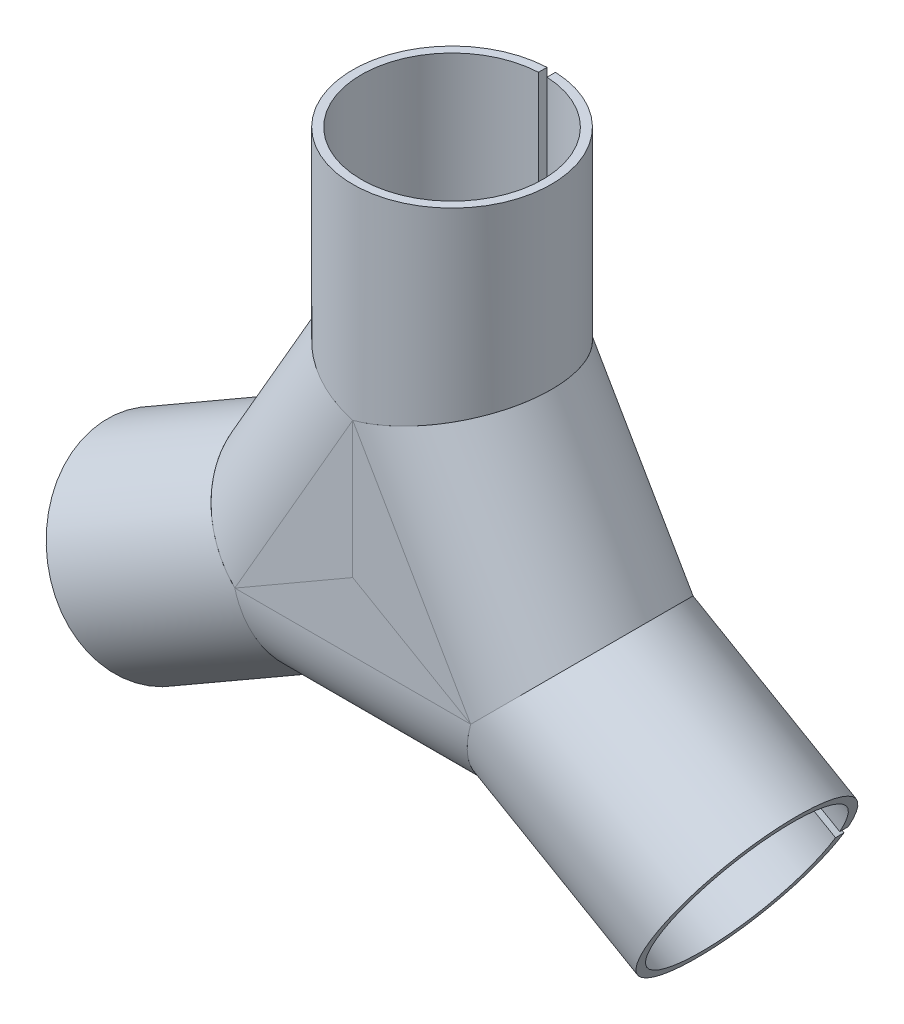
ISO-10303-21;
HEADER;
FILE_DESCRIPTION(('STEP AP214'),'2;1');
FILE_NAME('part.step','',(''),(''),'','','');
FILE_SCHEMA(('AUTOMOTIVE_DESIGN { 1 0 10303 214 1 1 1 1 }'));
ENDSEC;
DATA;
#1=APPLICATION_CONTEXT('core data for automotive mechanical design processes');
#2=APPLICATION_PROTOCOL_DEFINITION('international standard','automotive_design',2000,#1);
#3=PRODUCT_CONTEXT('',#1,'mechanical');
#4=PRODUCT('Part','Part','',(#3));
#5=PRODUCT_RELATED_PRODUCT_CATEGORY('part','',(#4));
#6=PRODUCT_DEFINITION_FORMATION('','',#4);
#7=PRODUCT_DEFINITION_CONTEXT('part definition',#1,'design');
#8=PRODUCT_DEFINITION('design','',#6,#7);
#9=PRODUCT_DEFINITION_SHAPE('','',#8);
#10=(LENGTH_UNIT() NAMED_UNIT(*) SI_UNIT(.MILLI.,.METRE.));
#11=(NAMED_UNIT(*) PLANE_ANGLE_UNIT() SI_UNIT($,.RADIAN.));
#12=(NAMED_UNIT(*) SI_UNIT($,.STERADIAN.) SOLID_ANGLE_UNIT());
#13=UNCERTAINTY_MEASURE_WITH_UNIT(LENGTH_MEASURE(1.E-05),#10,'distance_accuracy_value','');
#14=(GEOMETRIC_REPRESENTATION_CONTEXT(3) GLOBAL_UNCERTAINTY_ASSIGNED_CONTEXT((#13)) GLOBAL_UNIT_ASSIGNED_CONTEXT((#10,
#11,#12)) REPRESENTATION_CONTEXT('',''));
#15=CARTESIAN_POINT('',(0.,0.,0.));
#16=DIRECTION('',(0.,0.,1.));
#17=DIRECTION('',(1.,0.,0.));
#18=AXIS2_PLACEMENT_3D('',#15,#16,#17);
#19=CARTESIAN_POINT('',(34.6410161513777,-19.9999999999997,0.));
#20=DIRECTION('',(-0.866025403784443,0.499999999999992,0.));
#21=DIRECTION('',(0.,0.,-1.));
#22=AXIS2_PLACEMENT_3D('',#19,#20,#21);
#23=CYLINDRICAL_SURFACE('',#22,11.6658295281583);
#24=CARTESIAN_POINT('',(13.8564064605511,-7.99999999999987,0.));
#25=DIRECTION('',(-0.965925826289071,0.258819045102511,0.));
#26=DIRECTION('',(0.258819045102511,0.965925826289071,0.));
#27=AXIS2_PLACEMENT_3D('',#24,#25,#26);
#28=ELLIPSE('',#27,12.0773554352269,11.6658295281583);
#29=CARTESIAN_POINT('',(13.7224318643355,-8.49999999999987,-11.6551095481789));
#30=VERTEX_POINT('',#29);
#31=CARTESIAN_POINT('',(13.8564064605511,-7.99999999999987,11.6658295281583));
#32=VERTEX_POINT('',#31);
#33=EDGE_CURVE('E132',#30,#32,#28,.T.);
#34=ORIENTED_EDGE('',*,*,#33,.F.);
#35=DIRECTION('',(-0.866025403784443,0.499999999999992,0.));
#36=VECTOR('',#35,1.);
#37=CARTESIAN_POINT('',(34.3910161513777,-20.4330127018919,-11.6551095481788));
#38=LINE('',#37,#36);
#39=CARTESIAN_POINT('',(34.3910161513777,-20.4330127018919,-11.6551095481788));
#40=VERTEX_POINT('',#39);
#41=EDGE_CURVE('E77',#30,#40,#38,.F.);
#42=ORIENTED_EDGE('',*,*,#41,.T.);
#43=CARTESIAN_POINT('',(34.6410161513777,-19.9999999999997,0.));
#44=DIRECTION('',(0.866025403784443,-0.499999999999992,0.));
#45=DIRECTION('',(0.,0.,1.));
#46=AXIS2_PLACEMENT_3D('',#43,#44,#45);
#47=CIRCLE('',#46,11.6658295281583);
#48=CARTESIAN_POINT('',(34.8910161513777,-19.5669872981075,-11.6551095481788));
#49=VERTEX_POINT('',#48);
#50=EDGE_CURVE('E121',#49,#40,#47,.T.);
#51=ORIENTED_EDGE('',*,*,#50,.F.);
#52=DIRECTION('',(-0.866025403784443,0.499999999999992,0.));
#53=VECTOR('',#52,1.);
#54=CARTESIAN_POINT('',(34.8910161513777,-19.5669872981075,-11.6551095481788));
#55=LINE('',#54,#53);
#56=CARTESIAN_POINT('',(14.2224318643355,-7.63397459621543,-11.6551095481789));
#57=VERTEX_POINT('',#56);
#58=EDGE_CURVE('E107',#57,#49,#55,.F.);
#59=ORIENTED_EDGE('',*,*,#58,.F.);
#60=CARTESIAN_POINT('',(13.8564064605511,-7.99999999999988,0.));
#61=DIRECTION('',(-0.707106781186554,0.707106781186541,0.));
#62=DIRECTION('',(-0.707106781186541,-0.707106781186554,0.));
#63=AXIS2_PLACEMENT_3D('',#60,#61,#62);
#64=ELLIPSE('',#63,12.0773554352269,11.6658295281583);
#65=EDGE_CURVE('E141',#32,#57,#64,.T.);
#66=ORIENTED_EDGE('',*,*,#65,.F.);
#67=EDGE_LOOP('',(#34,#42,#51,#59,#66));
#68=FACE_BOUND('',#67,.T.);
#69=ADVANCED_FACE('F64',(#68),#23,.T.);
#70=CARTESIAN_POINT('',(22.3963863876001,0.539979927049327,-11.6658295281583));
#71=DIRECTION('',(-0.707106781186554,0.707106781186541,0.));
#72=DIRECTION('',(-0.707106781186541,-0.707106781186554,0.));
#73=AXIS2_PLACEMENT_3D('',#70,#71,#72);
#74=PLANE('',#73);
#75=ORIENTED_EDGE('',*,*,#65,.T.);
#76=DIRECTION('',(0.,0.,1.));
#77=VECTOR('',#76,1.);
#78=CARTESIAN_POINT('',(14.2224318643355,-7.63397459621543,-11.6658295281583));
#79=LINE('',#78,#77);
#80=CARTESIAN_POINT('',(14.2224318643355,-7.63397459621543,-10.654103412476));
#81=VERTEX_POINT('',#80);
#82=EDGE_CURVE('E71',#57,#81,#79,.T.);
#83=ORIENTED_EDGE('',*,*,#82,.T.);
#84=CARTESIAN_POINT('',(13.8564064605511,-7.99999999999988,0.));
#85=DIRECTION('',(-0.707106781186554,0.707106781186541,0.));
#86=DIRECTION('',(-0.707106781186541,-0.707106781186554,0.));
#87=AXIS2_PLACEMENT_3D('',#84,#85,#86);
#88=ELLIPSE('',#87,11.0420792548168,10.6658295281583);
#89=CARTESIAN_POINT('',(13.8564064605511,-7.99999999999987,10.6658295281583));
#90=VERTEX_POINT('',#89);
#91=EDGE_CURVE('E127',#90,#81,#88,.T.);
#92=ORIENTED_EDGE('',*,*,#91,.F.);
#93=DIRECTION('',(0.,0.,1.));
#94=VECTOR('',#93,1.);
#95=CARTESIAN_POINT('',(13.8564064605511,-7.99999999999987,-11.6658295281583));
#96=LINE('',#95,#94);
#97=EDGE_CURVE('E149',#90,#32,#96,.T.);
#98=ORIENTED_EDGE('',*,*,#97,.T.);
#99=EDGE_LOOP('',(#75,#83,#92,#98));
#100=FACE_BOUND('',#99,.T.);
#101=ADVANCED_FACE('F138',(#100),#74,.T.);
#102=CARTESIAN_POINT('',(34.6410161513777,-19.9999999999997,0.));
#103=DIRECTION('',(-0.866025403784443,0.499999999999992,0.));
#104=DIRECTION('',(0.,0.,-1.));
#105=AXIS2_PLACEMENT_3D('',#102,#103,#104);
#106=CYLINDRICAL_SURFACE('',#105,10.6658295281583);
#107=DIRECTION('',(-0.866025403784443,0.499999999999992,0.));
#108=VECTOR('',#107,1.);
#109=CARTESIAN_POINT('',(34.3910161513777,-20.4330127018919,-10.654103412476));
#110=LINE('',#109,#108);
#111=CARTESIAN_POINT('',(13.7224318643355,-8.49999999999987,-10.654103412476));
#112=VERTEX_POINT('',#111);
#113=CARTESIAN_POINT('',(34.3910161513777,-20.4330127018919,-10.654103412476));
#114=VERTEX_POINT('',#113);
#115=EDGE_CURVE('E146',#112,#114,#110,.F.);
#116=ORIENTED_EDGE('',*,*,#115,.F.);
#117=CARTESIAN_POINT('',(13.8564064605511,-7.99999999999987,0.));
#118=DIRECTION('',(-0.965925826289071,0.258819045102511,0.));
#119=DIRECTION('',(0.258819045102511,0.965925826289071,0.));
#120=AXIS2_PLACEMENT_3D('',#117,#118,#119);
#121=ELLIPSE('',#120,11.0420792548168,10.6658295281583);
#122=EDGE_CURVE('E130',#112,#90,#121,.T.);
#123=ORIENTED_EDGE('',*,*,#122,.T.);
#124=ORIENTED_EDGE('',*,*,#91,.T.);
#125=DIRECTION('',(-0.866025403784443,0.499999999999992,0.));
#126=VECTOR('',#125,1.);
#127=CARTESIAN_POINT('',(34.8910161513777,-19.5669872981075,-10.654103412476));
#128=LINE('',#127,#126);
#129=CARTESIAN_POINT('',(34.8910161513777,-19.5669872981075,-10.654103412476));
#130=VERTEX_POINT('',#129);
#131=EDGE_CURVE('E85',#81,#130,#128,.F.);
#132=ORIENTED_EDGE('',*,*,#131,.T.);
#133=CARTESIAN_POINT('',(34.6410161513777,-19.9999999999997,0.));
#134=DIRECTION('',(0.866025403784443,-0.499999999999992,0.));
#135=DIRECTION('',(-0.499999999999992,-0.866025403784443,0.));
#136=AXIS2_PLACEMENT_3D('',#133,#134,#135);
#137=CIRCLE('',#136,10.6658295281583);
#138=EDGE_CURVE('E123',#130,#114,#137,.T.);
#139=ORIENTED_EDGE('',*,*,#138,.T.);
#140=EDGE_LOOP('',(#116,#123,#124,#132,#139));
#141=FACE_BOUND('',#140,.T.);
#142=ADVANCED_FACE('F144',(#141),#106,.F.);
#143=CARTESIAN_POINT('',(34.6410161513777,-19.9999999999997,0.));
#144=DIRECTION('',(0.866025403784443,-0.499999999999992,0.));
#145=DIRECTION('',(0.,0.,1.));
#146=AXIS2_PLACEMENT_3D('',#143,#144,#145);
#147=PLANE('',#146);
#148=DIRECTION('',(0.,0.,1.));
#149=VECTOR('',#148,1.);
#150=CARTESIAN_POINT('',(34.3910161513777,-20.4330127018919,-11.6658295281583));
#151=LINE('',#150,#149);
#152=EDGE_CURVE('E124',#40,#114,#151,.T.);
#153=ORIENTED_EDGE('',*,*,#152,.T.);
#154=ORIENTED_EDGE('',*,*,#138,.F.);
#155=DIRECTION('',(0.,0.,1.));
#156=VECTOR('',#155,1.);
#157=CARTESIAN_POINT('',(34.8910161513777,-19.5669872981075,-11.6658295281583));
#158=LINE('',#157,#156);
#159=EDGE_CURVE('E110',#49,#130,#158,.T.);
#160=ORIENTED_EDGE('',*,*,#159,.F.);
#161=ORIENTED_EDGE('',*,*,#50,.T.);
#162=EDGE_LOOP('',(#153,#154,#160,#161));
#163=FACE_BOUND('',#162,.T.);
#164=ADVANCED_FACE('F120',(#163),#147,.T.);
#165=CARTESIAN_POINT('',(13.8564064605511,-7.99999999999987,-11.6658295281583));
#166=DIRECTION('',(-0.965925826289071,0.258819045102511,0.));
#167=DIRECTION('',(-0.258819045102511,-0.965925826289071,0.));
#168=AXIS2_PLACEMENT_3D('',#165,#166,#167);
#169=PLANE('',#168);
#170=DIRECTION('',(0.,0.,1.));
#171=VECTOR('',#170,1.);
#172=CARTESIAN_POINT('',(13.7224318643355,-8.49999999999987,-11.6658295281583));
#173=LINE('',#172,#171);
#174=EDGE_CURVE('E14',#30,#112,#173,.T.);
#175=ORIENTED_EDGE('',*,*,#174,.F.);
#176=ORIENTED_EDGE('',*,*,#33,.T.);
#177=ORIENTED_EDGE('',*,*,#97,.F.);
#178=ORIENTED_EDGE('',*,*,#122,.F.);
#179=EDGE_LOOP('',(#175,#176,#177,#178));
#180=FACE_BOUND('',#179,.T.);
#181=ADVANCED_FACE('F148',(#180),#169,.T.);
#182=CARTESIAN_POINT('',(0.249999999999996,0.433012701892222,-11.6658295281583));
#183=DIRECTION('',(-0.499999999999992,-0.866025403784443,0.));
#184=DIRECTION('',(0.,0.,-1.));
#185=AXIS2_PLACEMENT_3D('',#182,#183,#184);
#186=PLANE('',#185);
#187=ORIENTED_EDGE('',*,*,#82,.F.);
#188=ORIENTED_EDGE('',*,*,#58,.T.);
#189=ORIENTED_EDGE('',*,*,#159,.T.);
#190=ORIENTED_EDGE('',*,*,#131,.F.);
#191=EDGE_LOOP('',(#187,#188,#189,#190));
#192=FACE_BOUND('',#191,.T.);
#193=ADVANCED_FACE('F109',(#192),#186,.T.);
#194=CARTESIAN_POINT('',(-0.249999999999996,-0.433012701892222,-11.6658295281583));
#195=DIRECTION('',(-0.499999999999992,-0.866025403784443,0.));
#196=DIRECTION('',(0.,0.,-1.));
#197=AXIS2_PLACEMENT_3D('',#194,#195,#196);
#198=PLANE('',#197);
#199=ORIENTED_EDGE('',*,*,#115,.T.);
#200=ORIENTED_EDGE('',*,*,#152,.F.);
#201=ORIENTED_EDGE('',*,*,#41,.F.);
#202=ORIENTED_EDGE('',*,*,#174,.T.);
#203=EDGE_LOOP('',(#199,#200,#201,#202));
#204=FACE_BOUND('',#203,.T.);
#205=ADVANCED_FACE('F156',(#204),#198,.F.);
#206=CLOSED_SHELL('',(#69,#101,#142,#164,#181,#193,#205));
#207=MANIFOLD_SOLID_BREP('B2',#206);
#208=CARTESIAN_POINT('',(-34.6410161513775,-20.0000000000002,0.));
#209=DIRECTION('',(0.866025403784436,0.500000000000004,0.));
#210=DIRECTION('',(0.,0.,-1.));
#211=AXIS2_PLACEMENT_3D('',#208,#209,#210);
#212=CYLINDRICAL_SURFACE('',#211,11.6658295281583);
#213=CARTESIAN_POINT('',(-13.856406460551,-8.00000000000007,0.));
#214=DIRECTION('',(0.707106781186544,0.707106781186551,0.));
#215=DIRECTION('',(0.707106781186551,-0.707106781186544,0.));
#216=AXIS2_PLACEMENT_3D('',#213,#214,#215);
#217=ELLIPSE('',#216,12.0773554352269,11.6658295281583);
#218=CARTESIAN_POINT('',(-14.2224318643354,-7.63397459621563,-11.6551095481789));
#219=VERTEX_POINT('',#218);
#220=CARTESIAN_POINT('',(-13.856406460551,-8.00000000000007,11.6658295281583));
#221=VERTEX_POINT('',#220);
#222=EDGE_CURVE('E292',#219,#221,#217,.T.);
#223=ORIENTED_EDGE('',*,*,#222,.F.);
#224=DIRECTION('',(0.866025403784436,0.500000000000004,0.));
#225=VECTOR('',#224,1.);
#226=CARTESIAN_POINT('',(-34.8910161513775,-19.5669872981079,-11.6551095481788));
#227=LINE('',#226,#225);
#228=CARTESIAN_POINT('',(-34.8910161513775,-19.5669872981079,-11.6551095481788));
#229=VERTEX_POINT('',#228);
#230=EDGE_CURVE('E237',#219,#229,#227,.F.);
#231=ORIENTED_EDGE('',*,*,#230,.T.);
#232=CARTESIAN_POINT('',(-34.6410161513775,-20.0000000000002,0.));
#233=DIRECTION('',(-0.866025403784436,-0.500000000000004,0.));
#234=DIRECTION('',(0.,0.,1.));
#235=AXIS2_PLACEMENT_3D('',#232,#233,#234);
#236=CIRCLE('',#235,11.6658295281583);
#237=CARTESIAN_POINT('',(-34.3910161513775,-20.4330127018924,-11.6551095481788));
#238=VERTEX_POINT('',#237);
#239=EDGE_CURVE('E281',#238,#229,#236,.T.);
#240=ORIENTED_EDGE('',*,*,#239,.F.);
#241=DIRECTION('',(0.866025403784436,0.500000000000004,0.));
#242=VECTOR('',#241,1.);
#243=CARTESIAN_POINT('',(-34.3910161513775,-20.4330127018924,-11.6551095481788));
#244=LINE('',#243,#242);
#245=CARTESIAN_POINT('',(-13.7224318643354,-8.50000000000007,-11.6551095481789));
#246=VERTEX_POINT('',#245);
#247=EDGE_CURVE('E267',#246,#238,#244,.F.);
#248=ORIENTED_EDGE('',*,*,#247,.F.);
#249=CARTESIAN_POINT('',(-13.856406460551,-8.00000000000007,0.));
#250=DIRECTION('',(0.965925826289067,0.258819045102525,0.));
#251=DIRECTION('',(-0.258819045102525,0.965925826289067,0.));
#252=AXIS2_PLACEMENT_3D('',#249,#250,#251);
#253=ELLIPSE('',#252,12.0773554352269,11.6658295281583);
#254=EDGE_CURVE('E301',#221,#246,#253,.T.);
#255=ORIENTED_EDGE('',*,*,#254,.F.);
#256=EDGE_LOOP('',(#223,#231,#240,#248,#255));
#257=FACE_BOUND('',#256,.T.);
#258=ADVANCED_FACE('F224',(#257),#212,.T.);
#259=CARTESIAN_POINT('',(-10.7305568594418,-19.6658295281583,-11.6658295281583));
#260=DIRECTION('',(0.965925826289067,0.258819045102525,0.));
#261=DIRECTION('',(-0.258819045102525,0.965925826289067,0.));
#262=AXIS2_PLACEMENT_3D('',#259,#260,#261);
#263=PLANE('',#262);
#264=ORIENTED_EDGE('',*,*,#254,.T.);
#265=DIRECTION('',(0.,0.,1.));
#266=VECTOR('',#265,1.);
#267=CARTESIAN_POINT('',(-13.7224318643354,-8.50000000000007,-11.6658295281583));
#268=LINE('',#267,#266);
#269=CARTESIAN_POINT('',(-13.7224318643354,-8.50000000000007,-10.654103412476));
#270=VERTEX_POINT('',#269);
#271=EDGE_CURVE('E231',#246,#270,#268,.T.);
#272=ORIENTED_EDGE('',*,*,#271,.T.);
#273=CARTESIAN_POINT('',(-13.856406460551,-8.00000000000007,0.));
#274=DIRECTION('',(0.965925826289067,0.258819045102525,0.));
#275=DIRECTION('',(-0.258819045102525,0.965925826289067,0.));
#276=AXIS2_PLACEMENT_3D('',#273,#274,#275);
#277=ELLIPSE('',#276,11.0420792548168,10.6658295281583);
#278=CARTESIAN_POINT('',(-13.856406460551,-8.00000000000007,10.6658295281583));
#279=VERTEX_POINT('',#278);
#280=EDGE_CURVE('E287',#279,#270,#277,.T.);
#281=ORIENTED_EDGE('',*,*,#280,.F.);
#282=DIRECTION('',(0.,0.,1.));
#283=VECTOR('',#282,1.);
#284=CARTESIAN_POINT('',(-13.856406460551,-8.00000000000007,-11.6658295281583));
#285=LINE('',#284,#283);
#286=EDGE_CURVE('E309',#279,#221,#285,.T.);
#287=ORIENTED_EDGE('',*,*,#286,.T.);
#288=EDGE_LOOP('',(#264,#272,#281,#287));
#289=FACE_BOUND('',#288,.T.);
#290=ADVANCED_FACE('F298',(#289),#263,.T.);
#291=CARTESIAN_POINT('',(-34.6410161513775,-20.0000000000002,0.));
#292=DIRECTION('',(0.866025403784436,0.500000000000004,0.));
#293=DIRECTION('',(0.,0.,-1.));
#294=AXIS2_PLACEMENT_3D('',#291,#292,#293);
#295=CYLINDRICAL_SURFACE('',#294,10.6658295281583);
#296=DIRECTION('',(0.866025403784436,0.500000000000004,0.));
#297=VECTOR('',#296,1.);
#298=CARTESIAN_POINT('',(-34.8910161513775,-19.5669872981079,-10.654103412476));
#299=LINE('',#298,#297);
#300=CARTESIAN_POINT('',(-14.2224318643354,-7.63397459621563,-10.654103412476));
#301=VERTEX_POINT('',#300);
#302=CARTESIAN_POINT('',(-34.8910161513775,-19.5669872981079,-10.654103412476));
#303=VERTEX_POINT('',#302);
#304=EDGE_CURVE('E306',#301,#303,#299,.F.);
#305=ORIENTED_EDGE('',*,*,#304,.F.);
#306=CARTESIAN_POINT('',(-13.856406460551,-8.00000000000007,0.));
#307=DIRECTION('',(0.707106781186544,0.707106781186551,0.));
#308=DIRECTION('',(0.707106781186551,-0.707106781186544,0.));
#309=AXIS2_PLACEMENT_3D('',#306,#307,#308);
#310=ELLIPSE('',#309,11.0420792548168,10.6658295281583);
#311=EDGE_CURVE('E290',#301,#279,#310,.T.);
#312=ORIENTED_EDGE('',*,*,#311,.T.);
#313=ORIENTED_EDGE('',*,*,#280,.T.);
#314=DIRECTION('',(0.866025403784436,0.500000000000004,0.));
#315=VECTOR('',#314,1.);
#316=CARTESIAN_POINT('',(-34.3910161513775,-20.4330127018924,-10.654103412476));
#317=LINE('',#316,#315);
#318=CARTESIAN_POINT('',(-34.3910161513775,-20.4330127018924,-10.654103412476));
#319=VERTEX_POINT('',#318);
#320=EDGE_CURVE('E245',#270,#319,#317,.F.);
#321=ORIENTED_EDGE('',*,*,#320,.T.);
#322=CARTESIAN_POINT('',(-34.6410161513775,-20.0000000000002,0.));
#323=DIRECTION('',(-0.866025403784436,-0.500000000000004,0.));
#324=DIRECTION('',(-0.500000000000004,0.866025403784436,0.));
#325=AXIS2_PLACEMENT_3D('',#322,#323,#324);
#326=CIRCLE('',#325,10.6658295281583);
#327=EDGE_CURVE('E283',#319,#303,#326,.T.);
#328=ORIENTED_EDGE('',*,*,#327,.T.);
#329=EDGE_LOOP('',(#305,#312,#313,#321,#328));
#330=FACE_BOUND('',#329,.T.);
#331=ADVANCED_FACE('F304',(#330),#295,.F.);
#332=CARTESIAN_POINT('',(-34.6410161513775,-20.0000000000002,0.));
#333=DIRECTION('',(-0.866025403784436,-0.500000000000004,0.));
#334=DIRECTION('',(0.,0.,1.));
#335=AXIS2_PLACEMENT_3D('',#332,#333,#334);
#336=PLANE('',#335);
#337=DIRECTION('',(0.,0.,1.));
#338=VECTOR('',#337,1.);
#339=CARTESIAN_POINT('',(-34.8910161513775,-19.5669872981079,-11.6658295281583));
#340=LINE('',#339,#338);
#341=EDGE_CURVE('E284',#229,#303,#340,.T.);
#342=ORIENTED_EDGE('',*,*,#341,.T.);
#343=ORIENTED_EDGE('',*,*,#327,.F.);
#344=DIRECTION('',(0.,0.,1.));
#345=VECTOR('',#344,1.);
#346=CARTESIAN_POINT('',(-34.3910161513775,-20.4330127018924,-11.6658295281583));
#347=LINE('',#346,#345);
#348=EDGE_CURVE('E270',#238,#319,#347,.T.);
#349=ORIENTED_EDGE('',*,*,#348,.F.);
#350=ORIENTED_EDGE('',*,*,#239,.T.);
#351=EDGE_LOOP('',(#342,#343,#349,#350));
#352=FACE_BOUND('',#351,.T.);
#353=ADVANCED_FACE('F280',(#352),#336,.T.);
#354=CARTESIAN_POINT('',(-13.856406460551,-8.00000000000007,-11.6658295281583));
#355=DIRECTION('',(0.707106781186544,0.707106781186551,0.));
#356=DIRECTION('',(-0.707106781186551,0.707106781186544,0.));
#357=AXIS2_PLACEMENT_3D('',#354,#355,#356);
#358=PLANE('',#357);
#359=DIRECTION('',(0.,0.,1.));
#360=VECTOR('',#359,1.);
#361=CARTESIAN_POINT('',(-14.2224318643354,-7.63397459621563,-11.6658295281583));
#362=LINE('',#361,#360);
#363=EDGE_CURVE('E62',#219,#301,#362,.T.);
#364=ORIENTED_EDGE('',*,*,#363,.F.);
#365=ORIENTED_EDGE('',*,*,#222,.T.);
#366=ORIENTED_EDGE('',*,*,#286,.F.);
#367=ORIENTED_EDGE('',*,*,#311,.F.);
#368=EDGE_LOOP('',(#364,#365,#366,#367));
#369=FACE_BOUND('',#368,.T.);
#370=ADVANCED_FACE('F308',(#369),#358,.T.);
#371=CARTESIAN_POINT('',(0.250000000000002,-0.433012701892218,-11.6658295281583));
#372=DIRECTION('',(-0.500000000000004,0.866025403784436,0.));
#373=DIRECTION('',(0.,0.,-1.));
#374=AXIS2_PLACEMENT_3D('',#371,#372,#373);
#375=PLANE('',#374);
#376=ORIENTED_EDGE('',*,*,#271,.F.);
#377=ORIENTED_EDGE('',*,*,#247,.T.);
#378=ORIENTED_EDGE('',*,*,#348,.T.);
#379=ORIENTED_EDGE('',*,*,#320,.F.);
#380=EDGE_LOOP('',(#376,#377,#378,#379));
#381=FACE_BOUND('',#380,.T.);
#382=ADVANCED_FACE('F269',(#381),#375,.T.);
#383=CARTESIAN_POINT('',(-0.250000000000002,0.433012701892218,-11.6658295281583));
#384=DIRECTION('',(-0.500000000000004,0.866025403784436,0.));
#385=DIRECTION('',(0.,0.,-1.));
#386=AXIS2_PLACEMENT_3D('',#383,#384,#385);
#387=PLANE('',#386);
#388=ORIENTED_EDGE('',*,*,#304,.T.);
#389=ORIENTED_EDGE('',*,*,#341,.F.);
#390=ORIENTED_EDGE('',*,*,#230,.F.);
#391=ORIENTED_EDGE('',*,*,#363,.T.);
#392=EDGE_LOOP('',(#388,#389,#390,#391));
#393=FACE_BOUND('',#392,.T.);
#394=ADVANCED_FACE('F316',(#393),#387,.F.);
#395=CLOSED_SHELL('',(#258,#290,#331,#353,#370,#382,#394));
#396=MANIFOLD_SOLID_BREP('B8',#395);
#397=CARTESIAN_POINT('',(13.8564064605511,-7.99999999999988,0.));
#398=DIRECTION('',(-0.500000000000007,0.866025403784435,0.));
#399=DIRECTION('',(-0.866025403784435,-0.500000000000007,0.));
#400=AXIS2_PLACEMENT_3D('',#397,#398,#399);
#401=CYLINDRICAL_SURFACE('',#400,10.6658295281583);
#402=DIRECTION('',(-0.500000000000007,0.866025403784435,0.));
#403=VECTOR('',#402,1.);
#404=CARTESIAN_POINT('',(13.8564064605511,-7.99999999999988,-10.6658295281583));
#405=LINE('',#404,#403);
#406=CARTESIAN_POINT('',(-1.14491749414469E-13,16.,-10.6658295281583));
#407=VERTEX_POINT('',#406);
#408=CARTESIAN_POINT('',(13.8564064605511,-7.99999999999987,-10.6658295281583));
#409=VERTEX_POINT('',#408);
#410=EDGE_CURVE('E448',#407,#409,#405,.F.);
#411=ORIENTED_EDGE('',*,*,#410,.T.);
#412=CARTESIAN_POINT('',(13.8564064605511,-7.99999999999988,0.));
#413=DIRECTION('',(0.707106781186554,-0.707106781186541,0.));
#414=DIRECTION('',(0.707106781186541,0.707106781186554,0.));
#415=AXIS2_PLACEMENT_3D('',#412,#413,#414);
#416=ELLIPSE('',#415,11.0420792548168,10.6658295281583);
#417=CARTESIAN_POINT('',(13.8564064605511,-7.99999999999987,10.6658295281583));
#418=VERTEX_POINT('',#417);
#419=EDGE_CURVE('E222',#409,#418,#416,.T.);
#420=ORIENTED_EDGE('',*,*,#419,.T.);
#421=DIRECTION('',(-0.500000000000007,0.866025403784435,0.));
#422=VECTOR('',#421,1.);
#423=CARTESIAN_POINT('',(13.8564064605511,-7.99999999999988,10.6658295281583));
#424=LINE('',#423,#422);
#425=CARTESIAN_POINT('',(-1.0842021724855E-13,16.,10.6658295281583));
#426=VERTEX_POINT('',#425);
#427=EDGE_CURVE('E493',#418,#426,#424,.T.);
#428=ORIENTED_EDGE('',*,*,#427,.T.);
#429=CARTESIAN_POINT('',(-1.18828558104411E-13,16.,0.));
#430=DIRECTION('',(-0.258819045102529,0.965925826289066,0.));
#431=DIRECTION('',(-0.965925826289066,-0.258819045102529,0.));
#432=AXIS2_PLACEMENT_3D('',#429,#430,#431);
#433=ELLIPSE('',#432,11.0420792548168,10.6658295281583);
#434=EDGE_CURVE('E486',#426,#407,#433,.T.);
#435=ORIENTED_EDGE('',*,*,#434,.T.);
#436=EDGE_LOOP('',(#411,#420,#428,#435));
#437=FACE_BOUND('',#436,.T.);
#438=ADVANCED_FACE('F384',(#437),#401,.F.);
#439=CARTESIAN_POINT('',(22.3963863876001,0.539979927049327,-11.6658295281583));
#440=DIRECTION('',(0.707106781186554,-0.707106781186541,0.));
#441=DIRECTION('',(0.707106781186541,0.707106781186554,0.));
#442=AXIS2_PLACEMENT_3D('',#439,#440,#441);
#443=PLANE('',#442);
#444=CARTESIAN_POINT('',(13.8564064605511,-7.99999999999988,0.));
#445=DIRECTION('',(0.707106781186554,-0.707106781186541,0.));
#446=DIRECTION('',(0.707106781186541,0.707106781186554,0.));
#447=AXIS2_PLACEMENT_3D('',#444,#445,#446);
#448=ELLIPSE('',#447,12.0773554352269,11.6658295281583);
#449=CARTESIAN_POINT('',(13.8564064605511,-7.99999999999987,-11.6658295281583));
#450=VERTEX_POINT('',#449);
#451=CARTESIAN_POINT('',(13.8564064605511,-7.99999999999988,11.6658295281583));
#452=VERTEX_POINT('',#451);
#453=EDGE_CURVE('E392',#450,#452,#448,.T.);
#454=ORIENTED_EDGE('',*,*,#453,.T.);
#455=DIRECTION('',(0.,0.,1.));
#456=VECTOR('',#455,1.);
#457=CARTESIAN_POINT('',(13.8564064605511,-7.99999999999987,-11.6658295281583));
#458=LINE('',#457,#456);
#459=EDGE_CURVE('E487',#418,#452,#458,.T.);
#460=ORIENTED_EDGE('',*,*,#459,.F.);
#461=ORIENTED_EDGE('',*,*,#419,.F.);
#462=EDGE_CURVE('E462',#450,#409,#458,.T.);
#463=ORIENTED_EDGE('',*,*,#462,.F.);
#464=EDGE_LOOP('',(#454,#460,#461,#463));
#465=FACE_BOUND('',#464,.T.);
#466=ADVANCED_FACE('F499',(#465),#443,.T.);
#467=CARTESIAN_POINT('',(11.6658295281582,19.1258496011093,-11.6658295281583));
#468=DIRECTION('',(-0.258819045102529,0.965925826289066,0.));
#469=DIRECTION('',(-0.965925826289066,-0.258819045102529,0.));
#470=AXIS2_PLACEMENT_3D('',#467,#468,#469);
#471=PLANE('',#470);
#472=CARTESIAN_POINT('',(-1.18828558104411E-13,16.,0.));
#473=DIRECTION('',(-0.258819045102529,0.965925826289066,0.));
#474=DIRECTION('',(-0.965925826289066,-0.258819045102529,0.));
#475=AXIS2_PLACEMENT_3D('',#472,#473,#474);
#476=ELLIPSE('',#475,12.0773554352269,11.6658295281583);
#477=CARTESIAN_POINT('',(-1.0842021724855E-13,16.,11.6658295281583));
#478=VERTEX_POINT('',#477);
#479=CARTESIAN_POINT('',(-1.04950770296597E-13,16.,-11.6658295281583));
#480=VERTEX_POINT('',#479);
#481=EDGE_CURVE('E490',#478,#480,#476,.T.);
#482=ORIENTED_EDGE('',*,*,#481,.T.);
#483=DIRECTION('',(0.,0.,1.));
#484=VECTOR('',#483,1.);
#485=CARTESIAN_POINT('',(-1.0842021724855E-13,16.,-11.6658295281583));
#486=LINE('',#485,#484);
#487=EDGE_CURVE('E407',#480,#407,#486,.T.);
#488=ORIENTED_EDGE('',*,*,#487,.T.);
#489=ORIENTED_EDGE('',*,*,#434,.F.);
#490=EDGE_CURVE('E484',#426,#478,#486,.T.);
#491=ORIENTED_EDGE('',*,*,#490,.T.);
#492=EDGE_LOOP('',(#482,#488,#489,#491));
#493=FACE_BOUND('',#492,.T.);
#494=ADVANCED_FACE('F505',(#493),#471,.T.);
#495=CARTESIAN_POINT('',(13.8564064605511,-7.99999999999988,0.));
#496=DIRECTION('',(-0.500000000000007,0.866025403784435,0.));
#497=DIRECTION('',(-0.866025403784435,-0.500000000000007,0.));
#498=AXIS2_PLACEMENT_3D('',#495,#496,#497);
#499=CYLINDRICAL_SURFACE('',#498,11.6658295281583);
#500=DIRECTION('',(0.500000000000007,-0.866025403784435,0.));
#501=VECTOR('',#500,1.);
#502=CARTESIAN_POINT('',(-1.0842021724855E-13,16.,-11.6658295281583));
#503=LINE('',#502,#501);
#504=EDGE_CURVE('E481',#480,#450,#503,.T.);
#505=ORIENTED_EDGE('',*,*,#504,.F.);
#506=ORIENTED_EDGE('',*,*,#481,.F.);
#507=DIRECTION('',(0.500000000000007,-0.866025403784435,0.));
#508=VECTOR('',#507,1.);
#509=CARTESIAN_POINT('',(-1.0842021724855E-13,16.,11.6658295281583));
#510=LINE('',#509,#508);
#511=EDGE_CURVE('E478',#478,#452,#510,.T.);
#512=ORIENTED_EDGE('',*,*,#511,.T.);
#513=ORIENTED_EDGE('',*,*,#453,.F.);
#514=EDGE_LOOP('',(#505,#506,#512,#513));
#515=FACE_BOUND('',#514,.T.);
#516=ADVANCED_FACE('F386',(#515),#499,.T.);
#517=CARTESIAN_POINT('',(13.8564064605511,-7.99999999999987,10.6658295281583));
#518=DIRECTION('',(-0.499999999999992,-0.866025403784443,0.));
#519=DIRECTION('',(0.866025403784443,-0.499999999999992,0.));
#520=AXIS2_PLACEMENT_3D('',#517,#518,#519);
#521=PLANE('',#520);
#522=DIRECTION('',(0.866025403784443,-0.499999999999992,0.));
#523=VECTOR('',#522,1.);
#524=CARTESIAN_POINT('',(13.8564064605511,-7.99999999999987,11.6658295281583));
#525=LINE('',#524,#523);
#526=CARTESIAN_POINT('',(0.,0.,11.6658295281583));
#527=VERTEX_POINT('',#526);
#528=EDGE_CURVE('E399',#527,#452,#525,.T.);
#529=ORIENTED_EDGE('',*,*,#528,.F.);
#530=DIRECTION('',(0.,0.,1.));
#531=VECTOR('',#530,1.);
#532=CARTESIAN_POINT('',(0.,0.,10.6658295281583));
#533=LINE('',#532,#531);
#534=CARTESIAN_POINT('',(0.,0.,10.6658295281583));
#535=VERTEX_POINT('',#534);
#536=EDGE_CURVE('E474',#535,#527,#533,.T.);
#537=ORIENTED_EDGE('',*,*,#536,.F.);
#538=DIRECTION('',(0.866025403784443,-0.499999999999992,0.));
#539=VECTOR('',#538,1.);
#540=CARTESIAN_POINT('',(13.8564064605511,-7.99999999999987,10.6658295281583));
#541=LINE('',#540,#539);
#542=EDGE_CURVE('E471',#535,#418,#541,.T.);
#543=ORIENTED_EDGE('',*,*,#542,.T.);
#544=ORIENTED_EDGE('',*,*,#459,.T.);
#545=EDGE_LOOP('',(#529,#537,#543,#544));
#546=FACE_BOUND('',#545,.T.);
#547=ADVANCED_FACE('F513',(#546),#521,.T.);
#548=CARTESIAN_POINT('',(0.,0.,10.6658295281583));
#549=DIRECTION('',(-1.,0.,0.));
#550=DIRECTION('',(0.,-1.,0.));
#551=AXIS2_PLACEMENT_3D('',#548,#549,#550);
#552=PLANE('',#551);
#553=DIRECTION('',(0.,-1.,0.));
#554=VECTOR('',#553,1.);
#555=CARTESIAN_POINT('',(0.,0.,11.6658295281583));
#556=LINE('',#555,#554);
#557=EDGE_CURVE('E459',#478,#527,#556,.T.);
#558=ORIENTED_EDGE('',*,*,#557,.F.);
#559=ORIENTED_EDGE('',*,*,#490,.F.);
#560=DIRECTION('',(0.,-1.,0.));
#561=VECTOR('',#560,1.);
#562=CARTESIAN_POINT('',(0.,0.,10.6658295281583));
#563=LINE('',#562,#561);
#564=EDGE_CURVE('E468',#426,#535,#563,.T.);
#565=ORIENTED_EDGE('',*,*,#564,.T.);
#566=ORIENTED_EDGE('',*,*,#536,.T.);
#567=EDGE_LOOP('',(#558,#559,#565,#566));
#568=FACE_BOUND('',#567,.T.);
#569=ADVANCED_FACE('F508',(#568),#552,.T.);
#570=CARTESIAN_POINT('',(13.8564064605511,-7.99999999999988,10.6658295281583));
#571=DIRECTION('',(0.,0.,-1.));
#572=DIRECTION('',(0.499999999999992,0.866025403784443,0.));
#573=AXIS2_PLACEMENT_3D('',#570,#571,#572);
#574=PLANE('',#573);
#575=ORIENTED_EDGE('',*,*,#427,.F.);
#576=ORIENTED_EDGE('',*,*,#542,.F.);
#577=ORIENTED_EDGE('',*,*,#564,.F.);
#578=EDGE_LOOP('',(#575,#576,#577));
#579=FACE_BOUND('',#578,.T.);
#580=ADVANCED_FACE('F511',(#579),#574,.T.);
#581=CARTESIAN_POINT('',(13.8564064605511,-7.99999999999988,11.6658295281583));
#582=DIRECTION('',(0.,0.,-1.));
#583=DIRECTION('',(0.499999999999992,0.866025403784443,0.));
#584=AXIS2_PLACEMENT_3D('',#581,#582,#583);
#585=PLANE('',#584);
#586=ORIENTED_EDGE('',*,*,#511,.F.);
#587=ORIENTED_EDGE('',*,*,#557,.T.);
#588=ORIENTED_EDGE('',*,*,#528,.T.);
#589=EDGE_LOOP('',(#586,#587,#588));
#590=FACE_BOUND('',#589,.T.);
#591=ADVANCED_FACE('F504',(#590),#585,.F.);
#592=CARTESIAN_POINT('',(0.,0.,-10.6658295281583));
#593=DIRECTION('',(1.,0.,0.));
#594=DIRECTION('',(0.,1.,0.));
#595=AXIS2_PLACEMENT_3D('',#592,#593,#594);
#596=PLANE('',#595);
#597=DIRECTION('',(0.,-1.,0.));
#598=VECTOR('',#597,1.);
#599=CARTESIAN_POINT('',(0.,0.,-11.6658295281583));
#600=LINE('',#599,#598);
#601=CARTESIAN_POINT('',(0.,0.,-11.6658295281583));
#602=VERTEX_POINT('',#601);
#603=EDGE_CURVE('E455',#480,#602,#600,.T.);
#604=ORIENTED_EDGE('',*,*,#603,.T.);
#605=DIRECTION('',(0.,0.,-1.));
#606=VECTOR('',#605,1.);
#607=CARTESIAN_POINT('',(0.,0.,-10.6658295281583));
#608=LINE('',#607,#606);
#609=CARTESIAN_POINT('',(0.,0.,-10.6658295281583));
#610=VERTEX_POINT('',#609);
#611=EDGE_CURVE('E450',#610,#602,#608,.T.);
#612=ORIENTED_EDGE('',*,*,#611,.F.);
#613=DIRECTION('',(0.,-1.,0.));
#614=VECTOR('',#613,1.);
#615=CARTESIAN_POINT('',(0.,0.,-10.6658295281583));
#616=LINE('',#615,#614);
#617=EDGE_CURVE('E441',#407,#610,#616,.T.);
#618=ORIENTED_EDGE('',*,*,#617,.F.);
#619=ORIENTED_EDGE('',*,*,#487,.F.);
#620=EDGE_LOOP('',(#604,#612,#618,#619));
#621=FACE_BOUND('',#620,.T.);
#622=ADVANCED_FACE('F453',(#621),#596,.F.);
#623=CARTESIAN_POINT('',(13.8564064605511,-7.99999999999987,-10.6658295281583));
#624=DIRECTION('',(0.499999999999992,0.866025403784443,0.));
#625=DIRECTION('',(-0.866025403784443,0.499999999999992,0.));
#626=AXIS2_PLACEMENT_3D('',#623,#624,#625);
#627=PLANE('',#626);
#628=DIRECTION('',(0.866025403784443,-0.499999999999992,0.));
#629=VECTOR('',#628,1.);
#630=CARTESIAN_POINT('',(13.8564064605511,-7.99999999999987,-11.6658295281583));
#631=LINE('',#630,#629);
#632=EDGE_CURVE('E464',#602,#450,#631,.T.);
#633=ORIENTED_EDGE('',*,*,#632,.T.);
#634=ORIENTED_EDGE('',*,*,#462,.T.);
#635=DIRECTION('',(0.866025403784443,-0.499999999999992,0.));
#636=VECTOR('',#635,1.);
#637=CARTESIAN_POINT('',(13.8564064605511,-7.99999999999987,-10.6658295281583));
#638=LINE('',#637,#636);
#639=EDGE_CURVE('E445',#610,#409,#638,.T.);
#640=ORIENTED_EDGE('',*,*,#639,.F.);
#641=ORIENTED_EDGE('',*,*,#611,.T.);
#642=EDGE_LOOP('',(#633,#634,#640,#641));
#643=FACE_BOUND('',#642,.T.);
#644=ADVANCED_FACE('F461',(#643),#627,.F.);
#645=CARTESIAN_POINT('',(13.8564064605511,-7.99999999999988,-10.6658295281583));
#646=DIRECTION('',(0.,0.,1.));
#647=DIRECTION('',(0.499999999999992,0.866025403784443,0.));
#648=AXIS2_PLACEMENT_3D('',#645,#646,#647);
#649=PLANE('',#648);
#650=ORIENTED_EDGE('',*,*,#410,.F.);
#651=ORIENTED_EDGE('',*,*,#617,.T.);
#652=ORIENTED_EDGE('',*,*,#639,.T.);
#653=EDGE_LOOP('',(#650,#651,#652));
#654=FACE_BOUND('',#653,.T.);
#655=ADVANCED_FACE('F443',(#654),#649,.T.);
#656=CARTESIAN_POINT('',(13.8564064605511,-7.99999999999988,-11.6658295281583));
#657=DIRECTION('',(0.,0.,1.));
#658=DIRECTION('',(0.499999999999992,0.866025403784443,0.));
#659=AXIS2_PLACEMENT_3D('',#656,#657,#658);
#660=PLANE('',#659);
#661=ORIENTED_EDGE('',*,*,#504,.T.);
#662=ORIENTED_EDGE('',*,*,#632,.F.);
#663=ORIENTED_EDGE('',*,*,#603,.F.);
#664=EDGE_LOOP('',(#661,#662,#663));
#665=FACE_BOUND('',#664,.T.);
#666=ADVANCED_FACE('F588',(#665),#660,.F.);
#667=CLOSED_SHELL('',(#438,#466,#494,#516,#547,#569,#580,#591,#622,#644,#655,#666));
#668=MANIFOLD_SOLID_BREP('B56',#667);
#669=CARTESIAN_POINT('',(-13.856406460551,-8.00000000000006,0.));
#670=DIRECTION('',(1.,0.,0.));
#671=DIRECTION('',(0.,1.,0.));
#672=AXIS2_PLACEMENT_3D('',#669,#670,#671);
#673=CYLINDRICAL_SURFACE('',#672,10.6658295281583);
#674=DIRECTION('',(1.,0.,0.));
#675=VECTOR('',#674,1.);
#676=CARTESIAN_POINT('',(-13.856406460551,-8.00000000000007,-10.6658295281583));
#677=LINE('',#676,#675);
#678=CARTESIAN_POINT('',(13.856406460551,-7.99999999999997,-10.6658295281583));
#679=VERTEX_POINT('',#678);
#680=CARTESIAN_POINT('',(-13.856406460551,-8.00000000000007,-10.6658295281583));
#681=VERTEX_POINT('',#680);
#682=EDGE_CURVE('E688',#679,#681,#677,.F.);
#683=ORIENTED_EDGE('',*,*,#682,.T.);
#684=CARTESIAN_POINT('',(-13.856406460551,-8.00000000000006,0.));
#685=DIRECTION('',(-0.965925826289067,-0.258819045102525,0.));
#686=DIRECTION('',(0.258819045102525,-0.965925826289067,0.));
#687=AXIS2_PLACEMENT_3D('',#684,#685,#686);
#688=ELLIPSE('',#687,11.0420792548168,10.6658295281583);
#689=CARTESIAN_POINT('',(-13.856406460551,-8.00000000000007,10.6658295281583));
#690=VERTEX_POINT('',#689);
#691=EDGE_CURVE('E382',#681,#690,#688,.T.);
#692=ORIENTED_EDGE('',*,*,#691,.T.);
#693=DIRECTION('',(1.,0.,0.));
#694=VECTOR('',#693,1.);
#695=CARTESIAN_POINT('',(-13.856406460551,-8.00000000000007,10.6658295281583));
#696=LINE('',#695,#694);
#697=CARTESIAN_POINT('',(13.856406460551,-7.99999999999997,10.6658295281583));
#698=VERTEX_POINT('',#697);
#699=EDGE_CURVE('E733',#690,#698,#696,.T.);
#700=ORIENTED_EDGE('',*,*,#699,.T.);
#701=CARTESIAN_POINT('',(13.856406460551,-7.99999999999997,0.));
#702=DIRECTION('',(0.965925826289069,-0.258819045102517,0.));
#703=DIRECTION('',(0.258819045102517,0.965925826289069,0.));
#704=AXIS2_PLACEMENT_3D('',#701,#702,#703);
#705=ELLIPSE('',#704,11.0420792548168,10.6658295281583);
#706=EDGE_CURVE('E726',#698,#679,#705,.T.);
#707=ORIENTED_EDGE('',*,*,#706,.T.);
#708=EDGE_LOOP('',(#683,#692,#700,#707));
#709=FACE_BOUND('',#708,.T.);
#710=ADVANCED_FACE('F624',(#709),#673,.F.);
#711=CARTESIAN_POINT('',(-10.7305568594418,-19.6658295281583,-11.6658295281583));
#712=DIRECTION('',(-0.965925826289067,-0.258819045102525,0.));
#713=DIRECTION('',(0.258819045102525,-0.965925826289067,0.));
#714=AXIS2_PLACEMENT_3D('',#711,#712,#713);
#715=PLANE('',#714);
#716=CARTESIAN_POINT('',(-13.856406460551,-8.00000000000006,0.));
#717=DIRECTION('',(-0.965925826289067,-0.258819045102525,0.));
#718=DIRECTION('',(0.258819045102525,-0.965925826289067,0.));
#719=AXIS2_PLACEMENT_3D('',#716,#717,#718);
#720=ELLIPSE('',#719,12.0773554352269,11.6658295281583);
#721=CARTESIAN_POINT('',(-13.856406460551,-8.00000000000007,-11.6658295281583));
#722=VERTEX_POINT('',#721);
#723=CARTESIAN_POINT('',(-13.856406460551,-8.00000000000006,11.6658295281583));
#724=VERTEX_POINT('',#723);
#725=EDGE_CURVE('E632',#722,#724,#720,.T.);
#726=ORIENTED_EDGE('',*,*,#725,.T.);
#727=DIRECTION('',(0.,0.,1.));
#728=VECTOR('',#727,1.);
#729=CARTESIAN_POINT('',(-13.856406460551,-8.00000000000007,-11.6658295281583));
#730=LINE('',#729,#728);
#731=EDGE_CURVE('E727',#690,#724,#730,.T.);
#732=ORIENTED_EDGE('',*,*,#731,.F.);
#733=ORIENTED_EDGE('',*,*,#691,.F.);
#734=EDGE_CURVE('E702',#722,#681,#730,.T.);
#735=ORIENTED_EDGE('',*,*,#734,.F.);
#736=EDGE_LOOP('',(#726,#732,#733,#735));
#737=FACE_BOUND('',#736,.T.);
#738=ADVANCED_FACE('F739',(#737),#715,.T.);
#739=CARTESIAN_POINT('',(10.7305568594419,-19.6658295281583,-11.6658295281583));
#740=DIRECTION('',(0.965925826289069,-0.258819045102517,0.));
#741=DIRECTION('',(0.258819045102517,0.965925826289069,0.));
#742=AXIS2_PLACEMENT_3D('',#739,#740,#741);
#743=PLANE('',#742);
#744=CARTESIAN_POINT('',(13.856406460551,-7.99999999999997,0.));
#745=DIRECTION('',(0.965925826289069,-0.258819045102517,0.));
#746=DIRECTION('',(0.258819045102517,0.965925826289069,0.));
#747=AXIS2_PLACEMENT_3D('',#744,#745,#746);
#748=ELLIPSE('',#747,12.0773554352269,11.6658295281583);
#749=CARTESIAN_POINT('',(13.856406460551,-7.99999999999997,11.6658295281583));
#750=VERTEX_POINT('',#749);
#751=CARTESIAN_POINT('',(13.856406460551,-7.99999999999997,-11.6658295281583));
#752=VERTEX_POINT('',#751);
#753=EDGE_CURVE('E730',#750,#752,#748,.T.);
#754=ORIENTED_EDGE('',*,*,#753,.T.);
#755=DIRECTION('',(0.,0.,1.));
#756=VECTOR('',#755,1.);
#757=CARTESIAN_POINT('',(13.856406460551,-7.99999999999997,-11.6658295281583));
#758=LINE('',#757,#756);
#759=EDGE_CURVE('E647',#752,#679,#758,.T.);
#760=ORIENTED_EDGE('',*,*,#759,.T.);
#761=ORIENTED_EDGE('',*,*,#706,.F.);
#762=EDGE_CURVE('E724',#698,#750,#758,.T.);
#763=ORIENTED_EDGE('',*,*,#762,.T.);
#764=EDGE_LOOP('',(#754,#760,#761,#763));
#765=FACE_BOUND('',#764,.T.);
#766=ADVANCED_FACE('F745',(#765),#743,.T.);
#767=CARTESIAN_POINT('',(-13.856406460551,-8.00000000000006,0.));
#768=DIRECTION('',(1.,0.,0.));
#769=DIRECTION('',(0.,1.,0.));
#770=AXIS2_PLACEMENT_3D('',#767,#768,#769);
#771=CYLINDRICAL_SURFACE('',#770,11.6658295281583);
#772=DIRECTION('',(-1.,0.,0.));
#773=VECTOR('',#772,1.);
#774=CARTESIAN_POINT('',(13.856406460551,-7.99999999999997,-11.6658295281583));
#775=LINE('',#774,#773);
#776=EDGE_CURVE('E721',#752,#722,#775,.T.);
#777=ORIENTED_EDGE('',*,*,#776,.F.);
#778=ORIENTED_EDGE('',*,*,#753,.F.);
#779=DIRECTION('',(-1.,0.,0.));
#780=VECTOR('',#779,1.);
#781=CARTESIAN_POINT('',(13.856406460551,-7.99999999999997,11.6658295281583));
#782=LINE('',#781,#780);
#783=EDGE_CURVE('E718',#750,#724,#782,.T.);
#784=ORIENTED_EDGE('',*,*,#783,.T.);
#785=ORIENTED_EDGE('',*,*,#725,.F.);
#786=EDGE_LOOP('',(#777,#778,#784,#785));
#787=FACE_BOUND('',#786,.T.);
#788=ADVANCED_FACE('F626',(#787),#771,.T.);
#789=CARTESIAN_POINT('',(-13.856406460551,-8.00000000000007,10.6658295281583));
#790=DIRECTION('',(-0.500000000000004,0.866025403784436,0.));
#791=DIRECTION('',(-0.866025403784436,-0.500000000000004,0.));
#792=AXIS2_PLACEMENT_3D('',#789,#790,#791);
#793=PLANE('',#792);
#794=DIRECTION('',(-0.866025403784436,-0.500000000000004,0.));
#795=VECTOR('',#794,1.);
#796=CARTESIAN_POINT('',(-13.856406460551,-8.00000000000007,11.6658295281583));
#797=LINE('',#796,#795);
#798=CARTESIAN_POINT('',(0.,0.,11.6658295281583));
#799=VERTEX_POINT('',#798);
#800=EDGE_CURVE('E639',#799,#724,#797,.T.);
#801=ORIENTED_EDGE('',*,*,#800,.F.);
#802=DIRECTION('',(0.,0.,1.));
#803=VECTOR('',#802,1.);
#804=CARTESIAN_POINT('',(0.,0.,10.6658295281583));
#805=LINE('',#804,#803);
#806=CARTESIAN_POINT('',(0.,0.,10.6658295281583));
#807=VERTEX_POINT('',#806);
#808=EDGE_CURVE('E714',#807,#799,#805,.T.);
#809=ORIENTED_EDGE('',*,*,#808,.F.);
#810=DIRECTION('',(-0.866025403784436,-0.500000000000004,0.));
#811=VECTOR('',#810,1.);
#812=CARTESIAN_POINT('',(-13.856406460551,-8.00000000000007,10.6658295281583));
#813=LINE('',#812,#811);
#814=EDGE_CURVE('E711',#807,#690,#813,.T.);
#815=ORIENTED_EDGE('',*,*,#814,.T.);
#816=ORIENTED_EDGE('',*,*,#731,.T.);
#817=EDGE_LOOP('',(#801,#809,#815,#816));
#818=FACE_BOUND('',#817,.T.);
#819=ADVANCED_FACE('F753',(#818),#793,.T.);
#820=CARTESIAN_POINT('',(0.,0.,10.6658295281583));
#821=DIRECTION('',(0.499999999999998,0.86602540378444,0.));
#822=DIRECTION('',(-0.86602540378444,0.499999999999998,0.));
#823=AXIS2_PLACEMENT_3D('',#820,#821,#822);
#824=PLANE('',#823);
#825=DIRECTION('',(-0.86602540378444,0.499999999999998,0.));
#826=VECTOR('',#825,1.);
#827=CARTESIAN_POINT('',(0.,0.,11.6658295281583));
#828=LINE('',#827,#826);
#829=EDGE_CURVE('E699',#750,#799,#828,.T.);
#830=ORIENTED_EDGE('',*,*,#829,.F.);
#831=ORIENTED_EDGE('',*,*,#762,.F.);
#832=DIRECTION('',(-0.86602540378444,0.499999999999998,0.));
#833=VECTOR('',#832,1.);
#834=CARTESIAN_POINT('',(0.,0.,10.6658295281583));
#835=LINE('',#834,#833);
#836=EDGE_CURVE('E708',#698,#807,#835,.T.);
#837=ORIENTED_EDGE('',*,*,#836,.T.);
#838=ORIENTED_EDGE('',*,*,#808,.T.);
#839=EDGE_LOOP('',(#830,#831,#837,#838));
#840=FACE_BOUND('',#839,.T.);
#841=ADVANCED_FACE('F748',(#840),#824,.T.);
#842=CARTESIAN_POINT('',(-13.856406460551,-8.00000000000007,10.6658295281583));
#843=DIRECTION('',(0.,0.,-1.));
#844=DIRECTION('',(0.500000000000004,-0.866025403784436,0.));
#845=AXIS2_PLACEMENT_3D('',#842,#843,#844);
#846=PLANE('',#845);
#847=ORIENTED_EDGE('',*,*,#699,.F.);
#848=ORIENTED_EDGE('',*,*,#814,.F.);
#849=ORIENTED_EDGE('',*,*,#836,.F.);
#850=EDGE_LOOP('',(#847,#848,#849));
#851=FACE_BOUND('',#850,.T.);
#852=ADVANCED_FACE('F751',(#851),#846,.T.);
#853=CARTESIAN_POINT('',(-13.856406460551,-8.00000000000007,11.6658295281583));
#854=DIRECTION('',(0.,0.,-1.));
#855=DIRECTION('',(0.500000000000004,-0.866025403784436,0.));
#856=AXIS2_PLACEMENT_3D('',#853,#854,#855);
#857=PLANE('',#856);
#858=ORIENTED_EDGE('',*,*,#783,.F.);
#859=ORIENTED_EDGE('',*,*,#829,.T.);
#860=ORIENTED_EDGE('',*,*,#800,.T.);
#861=EDGE_LOOP('',(#858,#859,#860));
#862=FACE_BOUND('',#861,.T.);
#863=ADVANCED_FACE('F744',(#862),#857,.F.);
#864=CARTESIAN_POINT('',(0.,0.,-10.6658295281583));
#865=DIRECTION('',(-0.499999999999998,-0.86602540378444,0.));
#866=DIRECTION('',(0.86602540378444,-0.499999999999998,0.));
#867=AXIS2_PLACEMENT_3D('',#864,#865,#866);
#868=PLANE('',#867);
#869=DIRECTION('',(-0.86602540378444,0.499999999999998,0.));
#870=VECTOR('',#869,1.);
#871=CARTESIAN_POINT('',(0.,0.,-11.6658295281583));
#872=LINE('',#871,#870);
#873=CARTESIAN_POINT('',(0.,0.,-11.6658295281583));
#874=VERTEX_POINT('',#873);
#875=EDGE_CURVE('E695',#752,#874,#872,.T.);
#876=ORIENTED_EDGE('',*,*,#875,.T.);
#877=DIRECTION('',(0.,0.,-1.));
#878=VECTOR('',#877,1.);
#879=CARTESIAN_POINT('',(0.,0.,-10.6658295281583));
#880=LINE('',#879,#878);
#881=CARTESIAN_POINT('',(0.,0.,-10.6658295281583));
#882=VERTEX_POINT('',#881);
#883=EDGE_CURVE('E690',#882,#874,#880,.T.);
#884=ORIENTED_EDGE('',*,*,#883,.F.);
#885=DIRECTION('',(-0.86602540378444,0.499999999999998,0.));
#886=VECTOR('',#885,1.);
#887=CARTESIAN_POINT('',(0.,0.,-10.6658295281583));
#888=LINE('',#887,#886);
#889=EDGE_CURVE('E681',#679,#882,#888,.T.);
#890=ORIENTED_EDGE('',*,*,#889,.F.);
#891=ORIENTED_EDGE('',*,*,#759,.F.);
#892=EDGE_LOOP('',(#876,#884,#890,#891));
#893=FACE_BOUND('',#892,.T.);
#894=ADVANCED_FACE('F693',(#893),#868,.F.);
#895=CARTESIAN_POINT('',(-13.856406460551,-8.00000000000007,-10.6658295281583));
#896=DIRECTION('',(0.500000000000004,-0.866025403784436,0.));
#897=DIRECTION('',(0.866025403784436,0.500000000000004,0.));
#898=AXIS2_PLACEMENT_3D('',#895,#896,#897);
#899=PLANE('',#898);
#900=DIRECTION('',(-0.866025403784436,-0.500000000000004,0.));
#901=VECTOR('',#900,1.);
#902=CARTESIAN_POINT('',(-13.856406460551,-8.00000000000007,-11.6658295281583));
#903=LINE('',#902,#901);
#904=EDGE_CURVE('E704',#874,#722,#903,.T.);
#905=ORIENTED_EDGE('',*,*,#904,.T.);
#906=ORIENTED_EDGE('',*,*,#734,.T.);
#907=DIRECTION('',(-0.866025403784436,-0.500000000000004,0.));
#908=VECTOR('',#907,1.);
#909=CARTESIAN_POINT('',(-13.856406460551,-8.00000000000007,-10.6658295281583));
#910=LINE('',#909,#908);
#911=EDGE_CURVE('E685',#882,#681,#910,.T.);
#912=ORIENTED_EDGE('',*,*,#911,.F.);
#913=ORIENTED_EDGE('',*,*,#883,.T.);
#914=EDGE_LOOP('',(#905,#906,#912,#913));
#915=FACE_BOUND('',#914,.T.);
#916=ADVANCED_FACE('F701',(#915),#899,.F.);
#917=CARTESIAN_POINT('',(-13.856406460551,-8.00000000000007,-10.6658295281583));
#918=DIRECTION('',(0.,0.,1.));
#919=DIRECTION('',(0.500000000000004,-0.866025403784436,0.));
#920=AXIS2_PLACEMENT_3D('',#917,#918,#919);
#921=PLANE('',#920);
#922=ORIENTED_EDGE('',*,*,#682,.F.);
#923=ORIENTED_EDGE('',*,*,#889,.T.);
#924=ORIENTED_EDGE('',*,*,#911,.T.);
#925=EDGE_LOOP('',(#922,#923,#924));
#926=FACE_BOUND('',#925,.T.);
#927=ADVANCED_FACE('F683',(#926),#921,.T.);
#928=CARTESIAN_POINT('',(-13.856406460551,-8.00000000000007,-11.6658295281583));
#929=DIRECTION('',(0.,0.,1.));
#930=DIRECTION('',(0.500000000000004,-0.866025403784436,0.));
#931=AXIS2_PLACEMENT_3D('',#928,#929,#930);
#932=PLANE('',#931);
#933=ORIENTED_EDGE('',*,*,#776,.T.);
#934=ORIENTED_EDGE('',*,*,#904,.F.);
#935=ORIENTED_EDGE('',*,*,#875,.F.);
#936=EDGE_LOOP('',(#933,#934,#935));
#937=FACE_BOUND('',#936,.T.);
#938=ADVANCED_FACE('F828',(#937),#932,.F.);
#939=CLOSED_SHELL('',(#710,#738,#766,#788,#819,#841,#852,#863,#894,#916,#927,#938));
#940=MANIFOLD_SOLID_BREP('B216',#939);
#941=CARTESIAN_POINT('',(0.,16.,0.));
#942=DIRECTION('',(-0.500000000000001,-0.866025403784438,0.));
#943=DIRECTION('',(0.866025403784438,-0.500000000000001,0.));
#944=AXIS2_PLACEMENT_3D('',#941,#942,#943);
#945=CYLINDRICAL_SURFACE('',#944,10.6658295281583);
#946=DIRECTION('',(-0.500000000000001,-0.866025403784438,0.));
#947=VECTOR('',#946,1.);
#948=CARTESIAN_POINT('',(0.,16.,-10.6658295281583));
#949=LINE('',#948,#947);
#950=CARTESIAN_POINT('',(-13.856406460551,-7.99999999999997,-10.6658295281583));
#951=VERTEX_POINT('',#950);
#952=CARTESIAN_POINT('',(0.,16.,-10.6658295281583));
#953=VERTEX_POINT('',#952);
#954=EDGE_CURVE('E927',#951,#953,#949,.F.);
#955=ORIENTED_EDGE('',*,*,#954,.T.);
#956=CARTESIAN_POINT('',(0.,16.,0.));
#957=DIRECTION('',(0.258819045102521,0.965925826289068,0.));
#958=DIRECTION('',(-0.965925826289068,0.258819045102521,0.));
#959=AXIS2_PLACEMENT_3D('',#956,#957,#958);
#960=ELLIPSE('',#959,11.0420792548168,10.6658295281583);
#961=CARTESIAN_POINT('',(0.,16.,10.6658295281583));
#962=VERTEX_POINT('',#961);
#963=EDGE_CURVE('E622',#953,#962,#960,.T.);
#964=ORIENTED_EDGE('',*,*,#963,.T.);
#965=DIRECTION('',(-0.500000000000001,-0.866025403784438,0.));
#966=VECTOR('',#965,1.);
#967=CARTESIAN_POINT('',(0.,16.,10.6658295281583));
#968=LINE('',#967,#966);
#969=CARTESIAN_POINT('',(-13.856406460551,-7.99999999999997,10.6658295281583));
#970=VERTEX_POINT('',#969);
#971=EDGE_CURVE('E972',#962,#970,#968,.T.);
#972=ORIENTED_EDGE('',*,*,#971,.T.);
#973=CARTESIAN_POINT('',(-13.856406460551,-7.99999999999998,0.));
#974=DIRECTION('',(-0.707106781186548,-0.707106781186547,0.));
#975=DIRECTION('',(0.707106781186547,-0.707106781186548,0.));
#976=AXIS2_PLACEMENT_3D('',#973,#974,#975);
#977=ELLIPSE('',#976,11.0420792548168,10.6658295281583);
#978=EDGE_CURVE('E965',#970,#951,#977,.T.);
#979=ORIENTED_EDGE('',*,*,#978,.T.);
#980=EDGE_LOOP('',(#955,#964,#972,#979));
#981=FACE_BOUND('',#980,.T.);
#982=ADVANCED_FACE('F863',(#981),#945,.F.);
#983=CARTESIAN_POINT('',(-11.6658295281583,19.1258496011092,-11.6658295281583));
#984=DIRECTION('',(0.258819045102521,0.965925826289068,0.));
#985=DIRECTION('',(-0.965925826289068,0.258819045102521,0.));
#986=AXIS2_PLACEMENT_3D('',#983,#984,#985);
#987=PLANE('',#986);
#988=CARTESIAN_POINT('',(0.,16.,0.));
#989=DIRECTION('',(0.258819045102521,0.965925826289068,0.));
#990=DIRECTION('',(-0.965925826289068,0.258819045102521,0.));
#991=AXIS2_PLACEMENT_3D('',#988,#989,#990);
#992=ELLIPSE('',#991,12.0773554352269,11.6658295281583);
#993=CARTESIAN_POINT('',(0.,16.,-11.6658295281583));
#994=VERTEX_POINT('',#993);
#995=CARTESIAN_POINT('',(0.,16.,11.6658295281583));
#996=VERTEX_POINT('',#995);
#997=EDGE_CURVE('E871',#994,#996,#992,.T.);
#998=ORIENTED_EDGE('',*,*,#997,.T.);
#999=DIRECTION('',(0.,0.,1.));
#1000=VECTOR('',#999,1.);
#1001=CARTESIAN_POINT('',(0.,16.,-11.6658295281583));
#1002=LINE('',#1001,#1000);
#1003=EDGE_CURVE('E966',#962,#996,#1002,.T.);
#1004=ORIENTED_EDGE('',*,*,#1003,.F.);
#1005=ORIENTED_EDGE('',*,*,#963,.F.);
#1006=EDGE_CURVE('E941',#994,#953,#1002,.T.);
#1007=ORIENTED_EDGE('',*,*,#1006,.F.);
#1008=EDGE_LOOP('',(#998,#1004,#1005,#1007));
#1009=FACE_BOUND('',#1008,.T.);
#1010=ADVANCED_FACE('F978',(#1009),#987,.T.);
#1011=CARTESIAN_POINT('',(-22.3963863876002,0.53997992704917,-11.6658295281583));
#1012=DIRECTION('',(-0.707106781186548,-0.707106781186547,0.));
#1013=DIRECTION('',(0.707106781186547,-0.707106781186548,0.));
#1014=AXIS2_PLACEMENT_3D('',#1011,#1012,#1013);
#1015=PLANE('',#1014);
#1016=CARTESIAN_POINT('',(-13.856406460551,-7.99999999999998,0.));
#1017=DIRECTION('',(-0.707106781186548,-0.707106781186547,0.));
#1018=DIRECTION('',(0.707106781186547,-0.707106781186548,0.));
#1019=AXIS2_PLACEMENT_3D('',#1016,#1017,#1018);
#1020=ELLIPSE('',#1019,12.0773554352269,11.6658295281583);
#1021=CARTESIAN_POINT('',(-13.856406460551,-7.99999999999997,11.6658295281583));
#1022=VERTEX_POINT('',#1021);
#1023=CARTESIAN_POINT('',(-13.856406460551,-7.99999999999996,-11.6658295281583));
#1024=VERTEX_POINT('',#1023);
#1025=EDGE_CURVE('E969',#1022,#1024,#1020,.T.);
#1026=ORIENTED_EDGE('',*,*,#1025,.T.);
#1027=DIRECTION('',(0.,0.,1.));
#1028=VECTOR('',#1027,1.);
#1029=CARTESIAN_POINT('',(-13.856406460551,-7.99999999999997,-11.6658295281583));
#1030=LINE('',#1029,#1028);
#1031=EDGE_CURVE('E886',#1024,#951,#1030,.T.);
#1032=ORIENTED_EDGE('',*,*,#1031,.T.);
#1033=ORIENTED_EDGE('',*,*,#978,.F.);
#1034=EDGE_CURVE('E963',#970,#1022,#1030,.T.);
#1035=ORIENTED_EDGE('',*,*,#1034,.T.);
#1036=EDGE_LOOP('',(#1026,#1032,#1033,#1035));
#1037=FACE_BOUND('',#1036,.T.);
#1038=ADVANCED_FACE('F984',(#1037),#1015,.T.);
#1039=CARTESIAN_POINT('',(0.,16.,0.));
#1040=DIRECTION('',(-0.500000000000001,-0.866025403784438,0.));
#1041=DIRECTION('',(0.866025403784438,-0.500000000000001,0.));
#1042=AXIS2_PLACEMENT_3D('',#1039,#1040,#1041);
#1043=CYLINDRICAL_SURFACE('',#1042,11.6658295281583);
#1044=DIRECTION('',(0.500000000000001,0.866025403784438,0.));
#1045=VECTOR('',#1044,1.);
#1046=CARTESIAN_POINT('',(-13.856406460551,-7.99999999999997,-11.6658295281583));
#1047=LINE('',#1046,#1045);
#1048=EDGE_CURVE('E960',#1024,#994,#1047,.T.);
#1049=ORIENTED_EDGE('',*,*,#1048,.F.);
#1050=ORIENTED_EDGE('',*,*,#1025,.F.);
#1051=DIRECTION('',(0.500000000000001,0.866025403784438,0.));
#1052=VECTOR('',#1051,1.);
#1053=CARTESIAN_POINT('',(-13.856406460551,-7.99999999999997,11.6658295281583));
#1054=LINE('',#1053,#1052);
#1055=EDGE_CURVE('E957',#1022,#996,#1054,.T.);
#1056=ORIENTED_EDGE('',*,*,#1055,.T.);
#1057=ORIENTED_EDGE('',*,*,#997,.F.);
#1058=EDGE_LOOP('',(#1049,#1050,#1056,#1057));
#1059=FACE_BOUND('',#1058,.T.);
#1060=ADVANCED_FACE('F865',(#1059),#1043,.T.);
#1061=CARTESIAN_POINT('',(0.,16.,10.6658295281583));
#1062=DIRECTION('',(1.,0.,0.));
#1063=DIRECTION('',(0.,1.,0.));
#1064=AXIS2_PLACEMENT_3D('',#1061,#1062,#1063);
#1065=PLANE('',#1064);
#1066=DIRECTION('',(0.,1.,0.));
#1067=VECTOR('',#1066,1.);
#1068=CARTESIAN_POINT('',(0.,16.,11.6658295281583));
#1069=LINE('',#1068,#1067);
#1070=CARTESIAN_POINT('',(0.,0.,11.6658295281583));
#1071=VERTEX_POINT('',#1070);
#1072=EDGE_CURVE('E878',#1071,#996,#1069,.T.);
#1073=ORIENTED_EDGE('',*,*,#1072,.F.);
#1074=DIRECTION('',(0.,0.,1.));
#1075=VECTOR('',#1074,1.);
#1076=CARTESIAN_POINT('',(0.,0.,10.6658295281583));
#1077=LINE('',#1076,#1075);
#1078=CARTESIAN_POINT('',(0.,0.,10.6658295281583));
#1079=VERTEX_POINT('',#1078);
#1080=EDGE_CURVE('E953',#1079,#1071,#1077,.T.);
#1081=ORIENTED_EDGE('',*,*,#1080,.F.);
#1082=DIRECTION('',(0.,1.,0.));
#1083=VECTOR('',#1082,1.);
#1084=CARTESIAN_POINT('',(0.,16.,10.6658295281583));
#1085=LINE('',#1084,#1083);
#1086=EDGE_CURVE('E950',#1079,#962,#1085,.T.);
#1087=ORIENTED_EDGE('',*,*,#1086,.T.);
#1088=ORIENTED_EDGE('',*,*,#1003,.T.);
#1089=EDGE_LOOP('',(#1073,#1081,#1087,#1088));
#1090=FACE_BOUND('',#1089,.T.);
#1091=ADVANCED_FACE('F992',(#1090),#1065,.T.);
#1092=CARTESIAN_POINT('',(0.,0.,10.6658295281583));
#1093=DIRECTION('',(0.499999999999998,-0.86602540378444,0.));
#1094=DIRECTION('',(0.86602540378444,0.499999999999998,0.));
#1095=AXIS2_PLACEMENT_3D('',#1092,#1093,#1094);
#1096=PLANE('',#1095);
#1097=DIRECTION('',(0.86602540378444,0.499999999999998,0.));
#1098=VECTOR('',#1097,1.);
#1099=CARTESIAN_POINT('',(0.,0.,11.6658295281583));
#1100=LINE('',#1099,#1098);
#1101=EDGE_CURVE('E938',#1022,#1071,#1100,.T.);
#1102=ORIENTED_EDGE('',*,*,#1101,.F.);
#1103=ORIENTED_EDGE('',*,*,#1034,.F.);
#1104=DIRECTION('',(0.86602540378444,0.499999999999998,0.));
#1105=VECTOR('',#1104,1.);
#1106=CARTESIAN_POINT('',(0.,0.,10.6658295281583));
#1107=LINE('',#1106,#1105);
#1108=EDGE_CURVE('E947',#970,#1079,#1107,.T.);
#1109=ORIENTED_EDGE('',*,*,#1108,.T.);
#1110=ORIENTED_EDGE('',*,*,#1080,.T.);
#1111=EDGE_LOOP('',(#1102,#1103,#1109,#1110));
#1112=FACE_BOUND('',#1111,.T.);
#1113=ADVANCED_FACE('F987',(#1112),#1096,.T.);
#1114=CARTESIAN_POINT('',(0.,16.,10.6658295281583));
#1115=DIRECTION('',(0.,0.,-1.));
#1116=DIRECTION('',(-1.,0.,0.));
#1117=AXIS2_PLACEMENT_3D('',#1114,#1115,#1116);
#1118=PLANE('',#1117);
#1119=ORIENTED_EDGE('',*,*,#971,.F.);
#1120=ORIENTED_EDGE('',*,*,#1086,.F.);
#1121=ORIENTED_EDGE('',*,*,#1108,.F.);
#1122=EDGE_LOOP('',(#1119,#1120,#1121));
#1123=FACE_BOUND('',#1122,.T.);
#1124=ADVANCED_FACE('F990',(#1123),#1118,.T.);
#1125=CARTESIAN_POINT('',(0.,16.,11.6658295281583));
#1126=DIRECTION('',(0.,0.,-1.));
#1127=DIRECTION('',(-1.,0.,0.));
#1128=AXIS2_PLACEMENT_3D('',#1125,#1126,#1127);
#1129=PLANE('',#1128);
#1130=ORIENTED_EDGE('',*,*,#1055,.F.);
#1131=ORIENTED_EDGE('',*,*,#1101,.T.);
#1132=ORIENTED_EDGE('',*,*,#1072,.T.);
#1133=EDGE_LOOP('',(#1130,#1131,#1132));
#1134=FACE_BOUND('',#1133,.T.);
#1135=ADVANCED_FACE('F983',(#1134),#1129,.F.);
#1136=CARTESIAN_POINT('',(0.,0.,-10.6658295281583));
#1137=DIRECTION('',(-0.499999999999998,0.86602540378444,0.));
#1138=DIRECTION('',(-0.86602540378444,-0.499999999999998,0.));
#1139=AXIS2_PLACEMENT_3D('',#1136,#1137,#1138);
#1140=PLANE('',#1139);
#1141=DIRECTION('',(0.86602540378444,0.499999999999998,0.));
#1142=VECTOR('',#1141,1.);
#1143=CARTESIAN_POINT('',(0.,0.,-11.6658295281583));
#1144=LINE('',#1143,#1142);
#1145=CARTESIAN_POINT('',(0.,0.,-11.6658295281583));
#1146=VERTEX_POINT('',#1145);
#1147=EDGE_CURVE('E934',#1024,#1146,#1144,.T.);
#1148=ORIENTED_EDGE('',*,*,#1147,.T.);
#1149=DIRECTION('',(0.,0.,-1.));
#1150=VECTOR('',#1149,1.);
#1151=CARTESIAN_POINT('',(0.,0.,-10.6658295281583));
#1152=LINE('',#1151,#1150);
#1153=CARTESIAN_POINT('',(0.,0.,-10.6658295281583));
#1154=VERTEX_POINT('',#1153);
#1155=EDGE_CURVE('E929',#1154,#1146,#1152,.T.);
#1156=ORIENTED_EDGE('',*,*,#1155,.F.);
#1157=DIRECTION('',(0.86602540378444,0.499999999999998,0.));
#1158=VECTOR('',#1157,1.);
#1159=CARTESIAN_POINT('',(0.,0.,-10.6658295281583));
#1160=LINE('',#1159,#1158);
#1161=EDGE_CURVE('E920',#951,#1154,#1160,.T.);
#1162=ORIENTED_EDGE('',*,*,#1161,.F.);
#1163=ORIENTED_EDGE('',*,*,#1031,.F.);
#1164=EDGE_LOOP('',(#1148,#1156,#1162,#1163));
#1165=FACE_BOUND('',#1164,.T.);
#1166=ADVANCED_FACE('F932',(#1165),#1140,.F.);
#1167=CARTESIAN_POINT('',(0.,16.,-10.6658295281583));
#1168=DIRECTION('',(-1.,0.,0.));
#1169=DIRECTION('',(0.,-1.,0.));
#1170=AXIS2_PLACEMENT_3D('',#1167,#1168,#1169);
#1171=PLANE('',#1170);
#1172=DIRECTION('',(0.,1.,0.));
#1173=VECTOR('',#1172,1.);
#1174=CARTESIAN_POINT('',(0.,16.,-11.6658295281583));
#1175=LINE('',#1174,#1173);
#1176=EDGE_CURVE('E943',#1146,#994,#1175,.T.);
#1177=ORIENTED_EDGE('',*,*,#1176,.T.);
#1178=ORIENTED_EDGE('',*,*,#1006,.T.);
#1179=DIRECTION('',(0.,1.,0.));
#1180=VECTOR('',#1179,1.);
#1181=CARTESIAN_POINT('',(0.,16.,-10.6658295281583));
#1182=LINE('',#1181,#1180);
#1183=EDGE_CURVE('E924',#1154,#953,#1182,.T.);
#1184=ORIENTED_EDGE('',*,*,#1183,.F.);
#1185=ORIENTED_EDGE('',*,*,#1155,.T.);
#1186=EDGE_LOOP('',(#1177,#1178,#1184,#1185));
#1187=FACE_BOUND('',#1186,.T.);
#1188=ADVANCED_FACE('F940',(#1187),#1171,.F.);
#1189=CARTESIAN_POINT('',(0.,16.,-10.6658295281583));
#1190=DIRECTION('',(0.,0.,1.));
#1191=DIRECTION('',(-1.,0.,0.));
#1192=AXIS2_PLACEMENT_3D('',#1189,#1190,#1191);
#1193=PLANE('',#1192);
#1194=ORIENTED_EDGE('',*,*,#954,.F.);
#1195=ORIENTED_EDGE('',*,*,#1161,.T.);
#1196=ORIENTED_EDGE('',*,*,#1183,.T.);
#1197=EDGE_LOOP('',(#1194,#1195,#1196));
#1198=FACE_BOUND('',#1197,.T.);
#1199=ADVANCED_FACE('F922',(#1198),#1193,.T.);
#1200=CARTESIAN_POINT('',(0.,16.,-11.6658295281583));
#1201=DIRECTION('',(0.,0.,1.));
#1202=DIRECTION('',(-1.,0.,0.));
#1203=AXIS2_PLACEMENT_3D('',#1200,#1201,#1202);
#1204=PLANE('',#1203);
#1205=ORIENTED_EDGE('',*,*,#1048,.T.);
#1206=ORIENTED_EDGE('',*,*,#1176,.F.);
#1207=ORIENTED_EDGE('',*,*,#1147,.F.);
#1208=EDGE_LOOP('',(#1205,#1206,#1207));
#1209=FACE_BOUND('',#1208,.T.);
#1210=ADVANCED_FACE('F1046',(#1209),#1204,.F.);
#1211=CLOSED_SHELL('',(#982,#1010,#1038,#1060,#1091,#1113,#1124,#1135,#1166,#1188,#1199,#1210));
#1212=MANIFOLD_SOLID_BREP('B376',#1211);
#1213=CARTESIAN_POINT('',(0.,40.,0.));
#1214=DIRECTION('',(0.,-1.,0.));
#1215=DIRECTION('',(0.,0.,-1.));
#1216=AXIS2_PLACEMENT_3D('',#1213,#1214,#1215);
#1217=CYLINDRICAL_SURFACE('',#1216,11.6658295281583);
#1218=CARTESIAN_POINT('',(0.,16.,0.));
#1219=DIRECTION('',(0.258819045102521,-0.965925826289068,0.));
#1220=DIRECTION('',(-0.965925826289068,-0.258819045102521,0.));
#1221=AXIS2_PLACEMENT_3D('',#1218,#1219,#1220);
#1222=ELLIPSE('',#1221,12.0773554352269,11.6658295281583);
#1223=CARTESIAN_POINT('',(0.5,16.1339745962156,-11.6551095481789));
#1224=VERTEX_POINT('',#1223);
#1225=CARTESIAN_POINT('',(0.,16.,11.6658295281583));
#1226=VERTEX_POINT('',#1225);
#1227=EDGE_CURVE('E1161',#1224,#1226,#1222,.T.);
#1228=ORIENTED_EDGE('',*,*,#1227,.F.);
#1229=DIRECTION('',(0.,-1.,0.));
#1230=VECTOR('',#1229,1.);
#1231=CARTESIAN_POINT('',(0.5,40.,-11.6551095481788));
#1232=LINE('',#1231,#1230);
#1233=CARTESIAN_POINT('',(0.5,40.,-11.6551095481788));
#1234=VERTEX_POINT('',#1233);
#1235=EDGE_CURVE('E1106',#1224,#1234,#1232,.F.);
#1236=ORIENTED_EDGE('',*,*,#1235,.T.);
#1237=CARTESIAN_POINT('',(0.,40.,0.));
#1238=DIRECTION('',(0.,1.,0.));
#1239=DIRECTION('',(0.,0.,1.));
#1240=AXIS2_PLACEMENT_3D('',#1237,#1238,#1239);
#1241=CIRCLE('',#1240,11.6658295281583);
#1242=CARTESIAN_POINT('',(-0.5,40.,-11.6551095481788));
#1243=VERTEX_POINT('',#1242);
#1244=EDGE_CURVE('E1150',#1243,#1234,#1241,.T.);
#1245=ORIENTED_EDGE('',*,*,#1244,.F.);
#1246=DIRECTION('',(0.,-1.,0.));
#1247=VECTOR('',#1246,1.);
#1248=CARTESIAN_POINT('',(-0.5,40.,-11.6551095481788));
#1249=LINE('',#1248,#1247);
#1250=CARTESIAN_POINT('',(-0.5,16.1339745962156,-11.6551095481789));
#1251=VERTEX_POINT('',#1250);
#1252=EDGE_CURVE('E1136',#1251,#1243,#1249,.F.);
#1253=ORIENTED_EDGE('',*,*,#1252,.F.);
#1254=CARTESIAN_POINT('',(0.,16.,0.));
#1255=DIRECTION('',(-0.258819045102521,-0.965925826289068,0.));
#1256=DIRECTION('',(0.965925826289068,-0.258819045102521,0.));
#1257=AXIS2_PLACEMENT_3D('',#1254,#1255,#1256);
#1258=ELLIPSE('',#1257,12.0773554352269,11.6658295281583);
#1259=EDGE_CURVE('E1170',#1226,#1251,#1258,.T.);
#1260=ORIENTED_EDGE('',*,*,#1259,.F.);
#1261=EDGE_LOOP('',(#1228,#1236,#1245,#1253,#1260));
#1262=FACE_BOUND('',#1261,.T.);
#1263=ADVANCED_FACE('F1093',(#1262),#1217,.T.);
#1264=CARTESIAN_POINT('',(-11.6658295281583,19.1258496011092,-11.6658295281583));
#1265=DIRECTION('',(-0.258819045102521,-0.965925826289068,0.));
#1266=DIRECTION('',(0.965925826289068,-0.258819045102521,0.));
#1267=AXIS2_PLACEMENT_3D('',#1264,#1265,#1266);
#1268=PLANE('',#1267);
#1269=ORIENTED_EDGE('',*,*,#1259,.T.);
#1270=DIRECTION('',(0.,0.,1.));
#1271=VECTOR('',#1270,1.);
#1272=CARTESIAN_POINT('',(-0.5,16.1339745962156,-11.6658295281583));
#1273=LINE('',#1272,#1271);
#1274=CARTESIAN_POINT('',(-0.5,16.1339745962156,-10.654103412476));
#1275=VERTEX_POINT('',#1274);
#1276=EDGE_CURVE('E1100',#1251,#1275,#1273,.T.);
#1277=ORIENTED_EDGE('',*,*,#1276,.T.);
#1278=CARTESIAN_POINT('',(0.,16.,0.));
#1279=DIRECTION('',(-0.258819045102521,-0.965925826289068,0.));
#1280=DIRECTION('',(0.965925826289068,-0.258819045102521,0.));
#1281=AXIS2_PLACEMENT_3D('',#1278,#1279,#1280);
#1282=ELLIPSE('',#1281,11.0420792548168,10.6658295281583);
#1283=CARTESIAN_POINT('',(0.,16.,10.6658295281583));
#1284=VERTEX_POINT('',#1283);
#1285=EDGE_CURVE('E1156',#1284,#1275,#1282,.T.);
#1286=ORIENTED_EDGE('',*,*,#1285,.F.);
#1287=DIRECTION('',(0.,0.,1.));
#1288=VECTOR('',#1287,1.);
#1289=CARTESIAN_POINT('',(0.,16.,-11.6658295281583));
#1290=LINE('',#1289,#1288);
#1291=EDGE_CURVE('E1178',#1284,#1226,#1290,.T.);
#1292=ORIENTED_EDGE('',*,*,#1291,.T.);
#1293=EDGE_LOOP('',(#1269,#1277,#1286,#1292));
#1294=FACE_BOUND('',#1293,.T.);
#1295=ADVANCED_FACE('F1167',(#1294),#1268,.T.);
#1296=CARTESIAN_POINT('',(0.,40.,0.));
#1297=DIRECTION('',(0.,-1.,0.));
#1298=DIRECTION('',(0.,0.,-1.));
#1299=AXIS2_PLACEMENT_3D('',#1296,#1297,#1298);
#1300=CYLINDRICAL_SURFACE('',#1299,10.6658295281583);
#1301=DIRECTION('',(0.,-1.,0.));
#1302=VECTOR('',#1301,1.);
#1303=CARTESIAN_POINT('',(0.5,40.,-10.654103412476));
#1304=LINE('',#1303,#1302);
#1305=CARTESIAN_POINT('',(0.5,16.1339745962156,-10.654103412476));
#1306=VERTEX_POINT('',#1305);
#1307=CARTESIAN_POINT('',(0.5,40.,-10.654103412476));
#1308=VERTEX_POINT('',#1307);
#1309=EDGE_CURVE('E1175',#1306,#1308,#1304,.F.);
#1310=ORIENTED_EDGE('',*,*,#1309,.F.);
#1311=CARTESIAN_POINT('',(0.,16.,0.));
#1312=DIRECTION('',(0.258819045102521,-0.965925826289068,0.));
#1313=DIRECTION('',(-0.965925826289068,-0.258819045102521,0.));
#1314=AXIS2_PLACEMENT_3D('',#1311,#1312,#1313);
#1315=ELLIPSE('',#1314,11.0420792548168,10.6658295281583);
#1316=EDGE_CURVE('E1159',#1306,#1284,#1315,.T.);
#1317=ORIENTED_EDGE('',*,*,#1316,.T.);
#1318=ORIENTED_EDGE('',*,*,#1285,.T.);
#1319=DIRECTION('',(0.,-1.,0.));
#1320=VECTOR('',#1319,1.);
#1321=CARTESIAN_POINT('',(-0.5,40.,-10.654103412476));
#1322=LINE('',#1321,#1320);
#1323=CARTESIAN_POINT('',(-0.5,40.,-10.654103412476));
#1324=VERTEX_POINT('',#1323);
#1325=EDGE_CURVE('E1114',#1275,#1324,#1322,.F.);
#1326=ORIENTED_EDGE('',*,*,#1325,.T.);
#1327=CARTESIAN_POINT('',(0.,40.,0.));
#1328=DIRECTION('',(0.,1.,0.));
#1329=DIRECTION('',(1.,0.,0.));
#1330=AXIS2_PLACEMENT_3D('',#1327,#1328,#1329);
#1331=CIRCLE('',#1330,10.6658295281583);
#1332=EDGE_CURVE('E1152',#1324,#1308,#1331,.T.);
#1333=ORIENTED_EDGE('',*,*,#1332,.T.);
#1334=EDGE_LOOP('',(#1310,#1317,#1318,#1326,#1333));
#1335=FACE_BOUND('',#1334,.T.);
#1336=ADVANCED_FACE('F1173',(#1335),#1300,.F.);
#1337=CARTESIAN_POINT('',(0.,40.,0.));
#1338=DIRECTION('',(0.,1.,0.));
#1339=DIRECTION('',(0.,0.,1.));
#1340=AXIS2_PLACEMENT_3D('',#1337,#1338,#1339);
#1341=PLANE('',#1340);
#1342=DIRECTION('',(0.,0.,1.));
#1343=VECTOR('',#1342,1.);
#1344=CARTESIAN_POINT('',(0.5,40.,-11.6658295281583));
#1345=LINE('',#1344,#1343);
#1346=EDGE_CURVE('E1153',#1234,#1308,#1345,.T.);
#1347=ORIENTED_EDGE('',*,*,#1346,.T.);
#1348=ORIENTED_EDGE('',*,*,#1332,.F.);
#1349=DIRECTION('',(0.,0.,1.));
#1350=VECTOR('',#1349,1.);
#1351=CARTESIAN_POINT('',(-0.5,40.,-11.6658295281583));
#1352=LINE('',#1351,#1350);
#1353=EDGE_CURVE('E1139',#1243,#1324,#1352,.T.);
#1354=ORIENTED_EDGE('',*,*,#1353,.F.);
#1355=ORIENTED_EDGE('',*,*,#1244,.T.);
#1356=EDGE_LOOP('',(#1347,#1348,#1354,#1355));
#1357=FACE_BOUND('',#1356,.T.);
#1358=ADVANCED_FACE('F1149',(#1357),#1341,.T.);
#1359=CARTESIAN_POINT('',(0.,16.,-11.6658295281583));
#1360=DIRECTION('',(0.258819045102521,-0.965925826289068,0.));
#1361=DIRECTION('',(0.965925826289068,0.258819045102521,0.));
#1362=AXIS2_PLACEMENT_3D('',#1359,#1360,#1361);
#1363=PLANE('',#1362);
#1364=DIRECTION('',(0.,0.,1.));
#1365=VECTOR('',#1364,1.);
#1366=CARTESIAN_POINT('',(0.5,16.1339745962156,-11.6658295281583));
#1367=LINE('',#1366,#1365);
#1368=EDGE_CURVE('E861',#1224,#1306,#1367,.T.);
#1369=ORIENTED_EDGE('',*,*,#1368,.F.);
#1370=ORIENTED_EDGE('',*,*,#1227,.T.);
#1371=ORIENTED_EDGE('',*,*,#1291,.F.);
#1372=ORIENTED_EDGE('',*,*,#1316,.F.);
#1373=EDGE_LOOP('',(#1369,#1370,#1371,#1372));
#1374=FACE_BOUND('',#1373,.T.);
#1375=ADVANCED_FACE('F1177',(#1374),#1363,.T.);
#1376=CARTESIAN_POINT('',(-0.5,0.,-11.6658295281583));
#1377=DIRECTION('',(1.,0.,0.));
#1378=DIRECTION('',(0.,0.,-1.));
#1379=AXIS2_PLACEMENT_3D('',#1376,#1377,#1378);
#1380=PLANE('',#1379);
#1381=ORIENTED_EDGE('',*,*,#1276,.F.);
#1382=ORIENTED_EDGE('',*,*,#1252,.T.);
#1383=ORIENTED_EDGE('',*,*,#1353,.T.);
#1384=ORIENTED_EDGE('',*,*,#1325,.F.);
#1385=EDGE_LOOP('',(#1381,#1382,#1383,#1384));
#1386=FACE_BOUND('',#1385,.T.);
#1387=ADVANCED_FACE('F1138',(#1386),#1380,.T.);
#1388=CARTESIAN_POINT('',(0.5,0.,-11.6658295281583));
#1389=DIRECTION('',(1.,0.,0.));
#1390=DIRECTION('',(0.,0.,-1.));
#1391=AXIS2_PLACEMENT_3D('',#1388,#1389,#1390);
#1392=PLANE('',#1391);
#1393=ORIENTED_EDGE('',*,*,#1309,.T.);
#1394=ORIENTED_EDGE('',*,*,#1346,.F.);
#1395=ORIENTED_EDGE('',*,*,#1235,.F.);
#1396=ORIENTED_EDGE('',*,*,#1368,.T.);
#1397=EDGE_LOOP('',(#1393,#1394,#1395,#1396));
#1398=FACE_BOUND('',#1397,.T.);
#1399=ADVANCED_FACE('F1185',(#1398),#1392,.F.);
#1400=CLOSED_SHELL('',(#1263,#1295,#1336,#1358,#1375,#1387,#1399));
#1401=MANIFOLD_SOLID_BREP('B616',#1400);
#1402=ADVANCED_BREP_SHAPE_REPRESENTATION('',(#18,#207,#396,#668,#940,#1212,#1401),#14);
#1403=SHAPE_DEFINITION_REPRESENTATION(#9,#1402);
ENDSEC;
END-ISO-10303-21;
